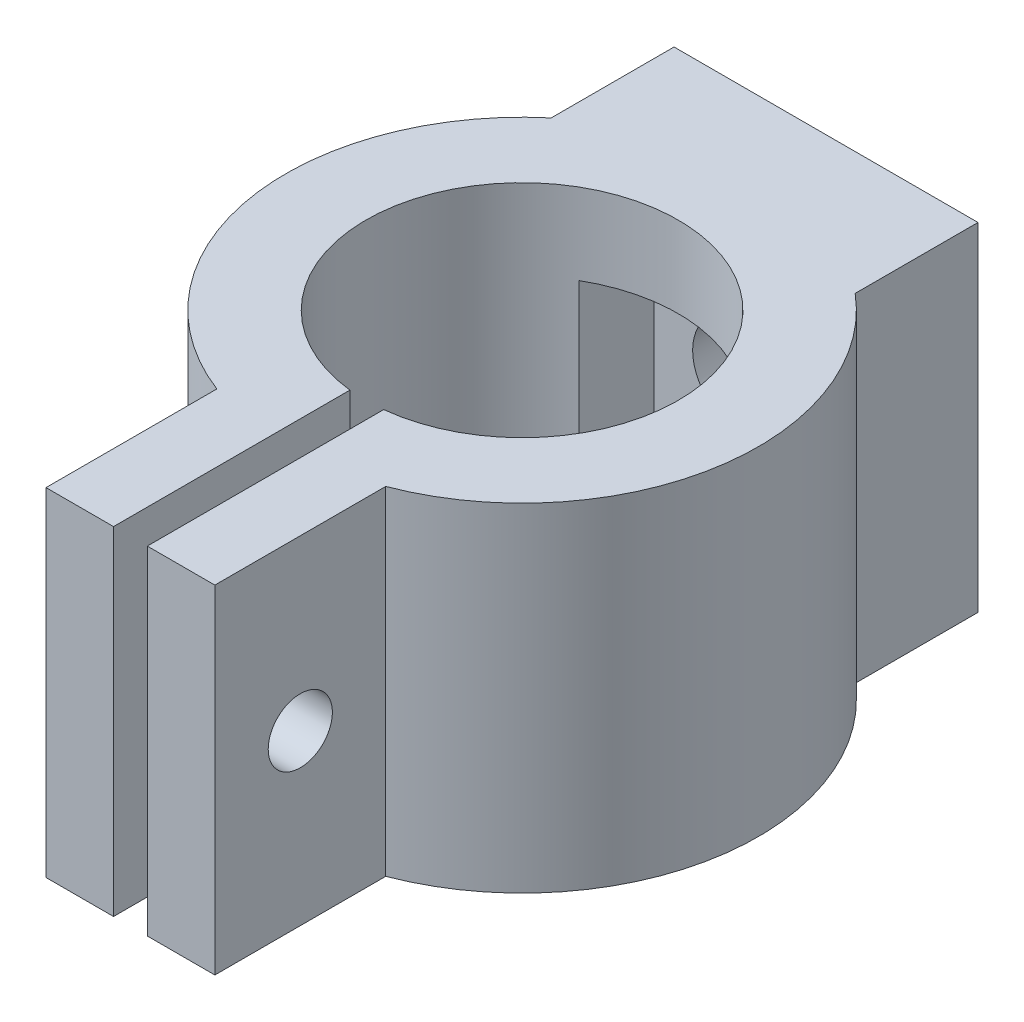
from build123d import *

# Parameters (mm, degrees)
BOSS_EXTRUDE1_DEPTH = 10
SKETCH2_R           = 1.45
CUT_EXTRUDE1_DEPTH  = 5
SKETCH3_R           = 0.95
CUT_EXTRUDE2_DEPTH  = 5
SKETCH4_W           = 5.2
SKETCH4_H           = 5.2
CUT_EXTRUDE3_DEPTH  = 2.5


with BuildPart() as part:
    # Sketch1 → Boss-Extrude1 (new body)
    with BuildSketch(Plane(origin=(0, 0, 0), x_dir=(1, 0, 0), z_dir=(0, 1, 0))):
        with BuildLine():
            Line((-4.5, 0), (4.5, 0))
            Line((4.5, 0), (4.5, -3.638097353))
            ThreePointArc((4.5, -3.638097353), (6.903187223, -10.160175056), (2.5, -15.538348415))
            Line((2.5, -15.538348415), (2.5, -20.597893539))
            Line((2.5, -20.597893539), (0.5, -20.597893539))
            Line((0.5, -20.597893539), (0.5, -13.597893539))
            ThreePointArc((0.5, -13.597893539), (0, -4.375), (-0.5, -13.597893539))
            Line((-0.5, -13.597893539), (-0.5, -20.597893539))
            Line((-0.5, -20.597893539), (-2.5, -20.597893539))
            Line((-2.5, -20.597893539), (-2.5, -15.538348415))
            ThreePointArc((-2.5, -15.538348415), (-6.903187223, -10.160175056), (-4.5, -3.638097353))
            Line((-4.5, -3.638097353), (-4.5, 0))
        make_face()
    extrude(amount=BOSS_EXTRUDE1_DEPTH)

    # Sketch2 → Cut-Extrude1 (cut)
    with BuildSketch(Plane(origin=(0, 0, 0), x_dir=(-1, 0, 0), z_dir=(0, 0, -1))):
        with Locations((0, 5)):
            Circle(SKETCH2_R)
    extrude(amount=-CUT_EXTRUDE1_DEPTH, mode=Mode.SUBTRACT)

    # Sketch3 → Cut-Extrude2 (cut)
    with BuildSketch(Plane.ZY.offset(2.5)):
        with Locations((18.068120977, 5)):
            Circle(SKETCH3_R)
    extrude(amount=-CUT_EXTRUDE2_DEPTH, mode=Mode.SUBTRACT)

    # Sketch4 → Cut-Extrude3 (cut)
    with BuildSketch(Plane(origin=(0, 0, 5), x_dir=(-1, 0, 0), z_dir=(0, 0, -1))):
        with Locations((0, 5)):
            Rectangle(SKETCH4_W, SKETCH4_H)
    extrude(amount=CUT_EXTRUDE3_DEPTH, mode=Mode.SUBTRACT)


solid = part.part
